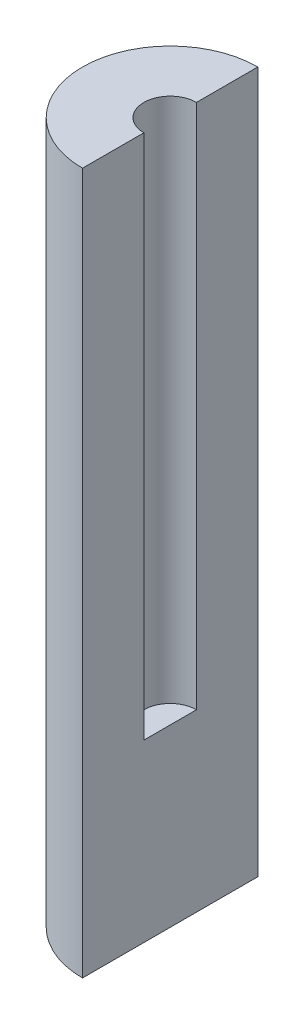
ISO-10303-21;
HEADER;
FILE_DESCRIPTION(('STEP AP214'),'2;1');
FILE_NAME('part.step','',(''),(''),'','','');
FILE_SCHEMA(('AUTOMOTIVE_DESIGN { 1 0 10303 214 1 1 1 1 }'));
ENDSEC;
DATA;
#1=APPLICATION_CONTEXT('core data for automotive mechanical design processes');
#2=APPLICATION_PROTOCOL_DEFINITION('international standard','automotive_design',2000,#1);
#3=PRODUCT_CONTEXT('',#1,'mechanical');
#4=PRODUCT('Part','Part','',(#3));
#5=PRODUCT_RELATED_PRODUCT_CATEGORY('part','',(#4));
#6=PRODUCT_DEFINITION_FORMATION('','',#4);
#7=PRODUCT_DEFINITION_CONTEXT('part definition',#1,'design');
#8=PRODUCT_DEFINITION('design','',#6,#7);
#9=PRODUCT_DEFINITION_SHAPE('','',#8);
#10=(LENGTH_UNIT() NAMED_UNIT(*) SI_UNIT(.MILLI.,.METRE.));
#11=(NAMED_UNIT(*) PLANE_ANGLE_UNIT() SI_UNIT($,.RADIAN.));
#12=(NAMED_UNIT(*) SI_UNIT($,.STERADIAN.) SOLID_ANGLE_UNIT());
#13=UNCERTAINTY_MEASURE_WITH_UNIT(LENGTH_MEASURE(1.E-05),#10,'distance_accuracy_value','');
#14=(GEOMETRIC_REPRESENTATION_CONTEXT(3) GLOBAL_UNCERTAINTY_ASSIGNED_CONTEXT((#13)) GLOBAL_UNIT_ASSIGNED_CONTEXT((#10,
#11,#12)) REPRESENTATION_CONTEXT('',''));
#15=CARTESIAN_POINT('',(0.,0.,0.));
#16=DIRECTION('',(0.,0.,1.));
#17=DIRECTION('',(1.,0.,0.));
#18=AXIS2_PLACEMENT_3D('',#15,#16,#17);
#19=CARTESIAN_POINT('',(0.,200.,0.));
#20=DIRECTION('',(0.,-1.,0.));
#21=DIRECTION('',(0.,0.,-1.));
#22=AXIS2_PLACEMENT_3D('',#19,#20,#21);
#23=CYLINDRICAL_SURFACE('',#22,25.);
#24=CARTESIAN_POINT('',(0.,200.,0.));
#25=DIRECTION('',(0.,1.,0.));
#26=DIRECTION('',(0.,0.,1.));
#27=AXIS2_PLACEMENT_3D('',#24,#25,#26);
#28=CIRCLE('',#27,25.);
#29=CARTESIAN_POINT('',(0.,200.,-25.));
#30=VERTEX_POINT('',#29);
#31=CARTESIAN_POINT('',(0.,200.,25.));
#32=VERTEX_POINT('',#31);
#33=EDGE_CURVE('E34',#30,#32,#28,.T.);
#34=ORIENTED_EDGE('',*,*,#33,.F.);
#35=DIRECTION('',(0.,1.,0.));
#36=VECTOR('',#35,1.);
#37=CARTESIAN_POINT('',(0.,0.,-25.));
#38=LINE('',#37,#36);
#39=CARTESIAN_POINT('',(0.,0.,-25.));
#40=VERTEX_POINT('',#39);
#41=EDGE_CURVE('E79',#40,#30,#38,.T.);
#42=ORIENTED_EDGE('',*,*,#41,.F.);
#43=CARTESIAN_POINT('',(0.,0.,0.));
#44=DIRECTION('',(0.,1.,0.));
#45=DIRECTION('',(0.,0.,1.));
#46=AXIS2_PLACEMENT_3D('',#43,#44,#45);
#47=CIRCLE('',#46,25.);
#48=CARTESIAN_POINT('',(0.,0.,25.));
#49=VERTEX_POINT('',#48);
#50=EDGE_CURVE('E78',#40,#49,#47,.T.);
#51=ORIENTED_EDGE('',*,*,#50,.T.);
#52=DIRECTION('',(0.,1.,0.));
#53=VECTOR('',#52,1.);
#54=CARTESIAN_POINT('',(0.,0.,25.));
#55=LINE('',#54,#53);
#56=EDGE_CURVE('E64',#49,#32,#55,.T.);
#57=ORIENTED_EDGE('',*,*,#56,.T.);
#58=EDGE_LOOP('',(#34,#42,#51,#57));
#59=FACE_BOUND('',#58,.T.);
#60=ADVANCED_FACE('F27',(#59),#23,.T.);
#61=CARTESIAN_POINT('',(0.,200.,0.));
#62=DIRECTION('',(0.,1.,0.));
#63=DIRECTION('',(0.,0.,1.));
#64=AXIS2_PLACEMENT_3D('',#61,#62,#63);
#65=PLANE('',#64);
#66=DIRECTION('',(0.,0.,1.));
#67=VECTOR('',#66,1.);
#68=CARTESIAN_POINT('',(0.,200.,-25.));
#69=LINE('',#68,#67);
#70=CARTESIAN_POINT('',(0.,200.,-7.5));
#71=VERTEX_POINT('',#70);
#72=EDGE_CURVE('E71',#30,#71,#69,.T.);
#73=ORIENTED_EDGE('',*,*,#72,.F.);
#74=ORIENTED_EDGE('',*,*,#33,.T.);
#75=CARTESIAN_POINT('',(0.,200.,7.5));
#76=VERTEX_POINT('',#75);
#77=EDGE_CURVE('E61',#76,#32,#69,.T.);
#78=ORIENTED_EDGE('',*,*,#77,.F.);
#79=CARTESIAN_POINT('',(0.,200.,0.));
#80=DIRECTION('',(0.,1.,0.));
#81=DIRECTION('',(0.,0.,1.));
#82=AXIS2_PLACEMENT_3D('',#79,#80,#81);
#83=CIRCLE('',#82,7.5);
#84=EDGE_CURVE('E89',#71,#76,#83,.T.);
#85=ORIENTED_EDGE('',*,*,#84,.F.);
#86=EDGE_LOOP('',(#73,#74,#78,#85));
#87=FACE_BOUND('',#86,.T.);
#88=ADVANCED_FACE('F83',(#87),#65,.T.);
#89=CARTESIAN_POINT('',(0.,0.,0.));
#90=DIRECTION('',(0.,1.,0.));
#91=DIRECTION('',(0.,0.,1.));
#92=AXIS2_PLACEMENT_3D('',#89,#90,#91);
#93=PLANE('',#92);
#94=ORIENTED_EDGE('',*,*,#50,.F.);
#95=DIRECTION('',(0.,0.,1.));
#96=VECTOR('',#95,1.);
#97=CARTESIAN_POINT('',(0.,0.,-25.));
#98=LINE('',#97,#96);
#99=EDGE_CURVE('E80',#40,#49,#98,.T.);
#100=ORIENTED_EDGE('',*,*,#99,.T.);
#101=EDGE_LOOP('',(#94,#100));
#102=FACE_BOUND('',#101,.T.);
#103=ADVANCED_FACE('F106',(#102),#93,.F.);
#104=CARTESIAN_POINT('',(0.,50.,0.));
#105=DIRECTION('',(0.,1.,0.));
#106=DIRECTION('',(0.,0.,1.));
#107=AXIS2_PLACEMENT_3D('',#104,#105,#106);
#108=CYLINDRICAL_SURFACE('',#107,7.5);
#109=ORIENTED_EDGE('',*,*,#84,.T.);
#110=DIRECTION('',(0.,1.,0.));
#111=VECTOR('',#110,1.);
#112=CARTESIAN_POINT('',(0.,50.,7.5));
#113=LINE('',#112,#111);
#114=CARTESIAN_POINT('',(0.,50.,7.5));
#115=VERTEX_POINT('',#114);
#116=EDGE_CURVE('E66',#76,#115,#113,.F.);
#117=ORIENTED_EDGE('',*,*,#116,.T.);
#118=CARTESIAN_POINT('',(0.,50.,0.));
#119=DIRECTION('',(0.,1.,0.));
#120=DIRECTION('',(0.,0.,1.));
#121=AXIS2_PLACEMENT_3D('',#118,#119,#120);
#122=CIRCLE('',#121,7.5);
#123=CARTESIAN_POINT('',(0.,50.,-7.5));
#124=VERTEX_POINT('',#123);
#125=EDGE_CURVE('E84',#124,#115,#122,.T.);
#126=ORIENTED_EDGE('',*,*,#125,.F.);
#127=DIRECTION('',(0.,1.,0.));
#128=VECTOR('',#127,1.);
#129=CARTESIAN_POINT('',(0.,50.,-7.5));
#130=LINE('',#129,#128);
#131=EDGE_CURVE('E40',#124,#71,#130,.T.);
#132=ORIENTED_EDGE('',*,*,#131,.T.);
#133=EDGE_LOOP('',(#109,#117,#126,#132));
#134=FACE_BOUND('',#133,.T.);
#135=ADVANCED_FACE('F96',(#134),#108,.F.);
#136=CARTESIAN_POINT('',(0.,50.,0.));
#137=DIRECTION('',(0.,1.,0.));
#138=DIRECTION('',(0.,0.,1.));
#139=AXIS2_PLACEMENT_3D('',#136,#137,#138);
#140=PLANE('',#139);
#141=DIRECTION('',(0.,0.,1.));
#142=VECTOR('',#141,1.);
#143=CARTESIAN_POINT('',(0.,50.,0.));
#144=LINE('',#143,#142);
#145=EDGE_CURVE('E11',#124,#115,#144,.T.);
#146=ORIENTED_EDGE('',*,*,#145,.F.);
#147=ORIENTED_EDGE('',*,*,#125,.T.);
#148=EDGE_LOOP('',(#146,#147));
#149=FACE_BOUND('',#148,.T.);
#150=ADVANCED_FACE('F98',(#149),#140,.T.);
#151=CARTESIAN_POINT('',(0.,0.,-25.));
#152=DIRECTION('',(-1.,0.,0.));
#153=DIRECTION('',(0.,0.,1.));
#154=AXIS2_PLACEMENT_3D('',#151,#152,#153);
#155=PLANE('',#154);
#156=ORIENTED_EDGE('',*,*,#77,.T.);
#157=ORIENTED_EDGE('',*,*,#56,.F.);
#158=ORIENTED_EDGE('',*,*,#99,.F.);
#159=ORIENTED_EDGE('',*,*,#41,.T.);
#160=ORIENTED_EDGE('',*,*,#72,.T.);
#161=ORIENTED_EDGE('',*,*,#131,.F.);
#162=ORIENTED_EDGE('',*,*,#145,.T.);
#163=ORIENTED_EDGE('',*,*,#116,.F.);
#164=EDGE_LOOP('',(#156,#157,#158,#159,#160,#161,#162,#163));
#165=FACE_BOUND('',#164,.T.);
#166=ADVANCED_FACE('F63',(#165),#155,.F.);
#167=CLOSED_SHELL('',(#60,#88,#103,#135,#150,#166));
#168=MANIFOLD_SOLID_BREP('B2',#167);
#169=ADVANCED_BREP_SHAPE_REPRESENTATION('',(#18,#168),#14);
#170=SHAPE_DEFINITION_REPRESENTATION(#9,#169);
ENDSEC;
END-ISO-10303-21;
